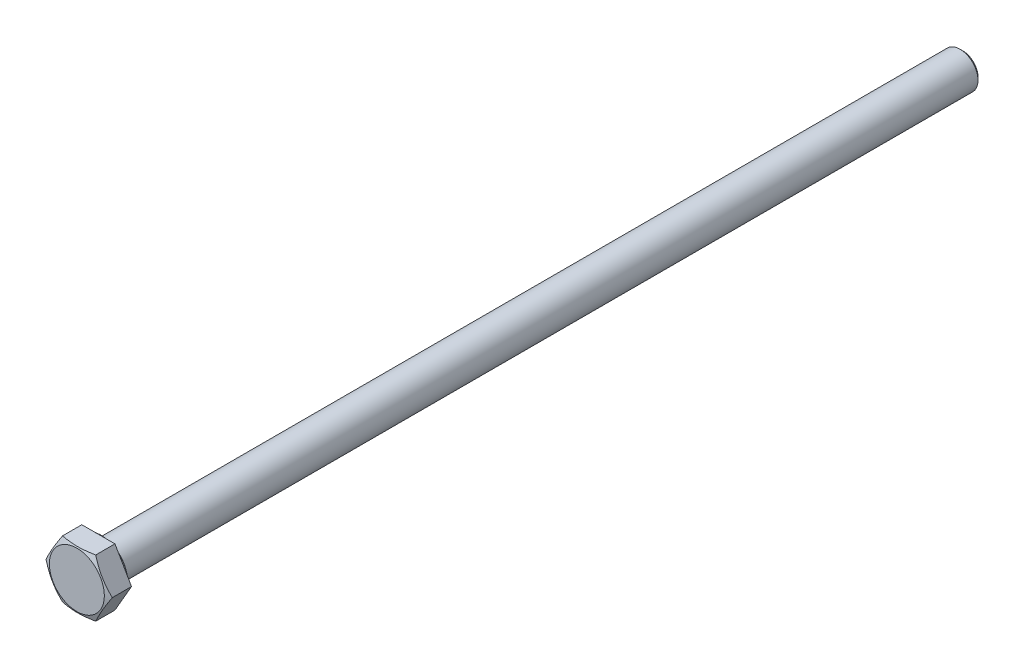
ISO-10303-21;
HEADER;
FILE_DESCRIPTION(('STEP AP214'),'2;1');
FILE_NAME('part.step','',(''),(''),'','','');
FILE_SCHEMA(('AUTOMOTIVE_DESIGN { 1 0 10303 214 1 1 1 1 }'));
ENDSEC;
DATA;
#1=APPLICATION_CONTEXT('core data for automotive mechanical design processes');
#2=APPLICATION_PROTOCOL_DEFINITION('international standard','automotive_design',2000,#1);
#3=PRODUCT_CONTEXT('',#1,'mechanical');
#4=PRODUCT('Part','Part','',(#3));
#5=PRODUCT_RELATED_PRODUCT_CATEGORY('part','',(#4));
#6=PRODUCT_DEFINITION_FORMATION('','',#4);
#7=PRODUCT_DEFINITION_CONTEXT('part definition',#1,'design');
#8=PRODUCT_DEFINITION('design','',#6,#7);
#9=PRODUCT_DEFINITION_SHAPE('','',#8);
#10=(LENGTH_UNIT() NAMED_UNIT(*) SI_UNIT(.MILLI.,.METRE.));
#11=(NAMED_UNIT(*) PLANE_ANGLE_UNIT() SI_UNIT($,.RADIAN.));
#12=(NAMED_UNIT(*) SI_UNIT($,.STERADIAN.) SOLID_ANGLE_UNIT());
#13=UNCERTAINTY_MEASURE_WITH_UNIT(LENGTH_MEASURE(1.E-05),#10,'distance_accuracy_value','');
#14=(GEOMETRIC_REPRESENTATION_CONTEXT(3) GLOBAL_UNCERTAINTY_ASSIGNED_CONTEXT((#13)) GLOBAL_UNIT_ASSIGNED_CONTEXT((#10,
#11,#12)) REPRESENTATION_CONTEXT('',''));
#15=CARTESIAN_POINT('',(0.,0.,0.));
#16=DIRECTION('',(0.,0.,1.));
#17=DIRECTION('',(1.,0.,0.));
#18=AXIS2_PLACEMENT_3D('',#15,#16,#17);
#19=CARTESIAN_POINT('',(0.,3.87,0.5));
#20=DIRECTION('',(0.,0.,1.));
#21=DIRECTION('',(1.,0.,0.));
#22=AXIS2_PLACEMENT_3D('',#19,#20,#21);
#23=PLANE('',#22);
#24=CARTESIAN_POINT('',(0.,0.,0.5));
#25=DIRECTION('',(0.,0.,1.));
#26=DIRECTION('',(1.,0.,0.));
#27=AXIS2_PLACEMENT_3D('',#24,#25,#26);
#28=CIRCLE('',#27,3.87);
#29=CARTESIAN_POINT('',(3.87,0.,0.5));
#30=VERTEX_POINT('',#29);
#31=EDGE_CURVE('E189',#30,#30,#28,.T.);
#32=ORIENTED_EDGE('',*,*,#31,.T.);
#33=EDGE_LOOP('',(#32));
#34=FACE_BOUND('',#33,.T.);
#35=DIRECTION('',(-1.,0.,0.));
#36=VECTOR('',#35,1.);
#37=CARTESIAN_POINT('',(0.,-3.99999813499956,0.5));
#38=LINE('',#37,#36);
#39=CARTESIAN_POINT('',(2.3094,-3.99999813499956,0.5));
#40=VERTEX_POINT('',#39);
#41=CARTESIAN_POINT('',(-2.3094,-3.99999813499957,0.5));
#42=VERTEX_POINT('',#41);
#43=EDGE_CURVE('E251',#40,#42,#38,.T.);
#44=ORIENTED_EDGE('',*,*,#43,.T.);
#45=DIRECTION('',(-0.5,0.866025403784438,0.));
#46=VECTOR('',#45,1.);
#47=CARTESIAN_POINT('',(-5.13985915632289,0.902500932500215,0.5));
#48=LINE('',#47,#46);
#49=CARTESIAN_POINT('',(-4.6188,0.,0.5));
#50=VERTEX_POINT('',#49);
#51=EDGE_CURVE('E103',#42,#50,#48,.T.);
#52=ORIENTED_EDGE('',*,*,#51,.T.);
#53=DIRECTION('',(0.5,0.866025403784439,0.));
#54=VECTOR('',#53,1.);
#55=CARTESIAN_POINT('',(-1.78834084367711,4.90249906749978,0.5));
#56=LINE('',#55,#54);
#57=CARTESIAN_POINT('',(-2.3094,3.99999813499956,0.5));
#58=VERTEX_POINT('',#57);
#59=EDGE_CURVE('E262',#50,#58,#56,.T.);
#60=ORIENTED_EDGE('',*,*,#59,.T.);
#61=DIRECTION('',(1.,0.,0.));
#62=VECTOR('',#61,1.);
#63=CARTESIAN_POINT('',(0.,3.99999813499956,0.5));
#64=LINE('',#63,#62);
#65=CARTESIAN_POINT('',(2.3094,3.99999813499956,0.5));
#66=VERTEX_POINT('',#65);
#67=EDGE_CURVE('E259',#58,#66,#64,.T.);
#68=ORIENTED_EDGE('',*,*,#67,.T.);
#69=DIRECTION('',(0.5,-0.866025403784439,0.));
#70=VECTOR('',#69,1.);
#71=CARTESIAN_POINT('',(1.78834084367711,4.90249906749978,0.5));
#72=LINE('',#71,#70);
#73=CARTESIAN_POINT('',(4.6188,0.,0.5));
#74=VERTEX_POINT('',#73);
#75=EDGE_CURVE('E236',#66,#74,#72,.T.);
#76=ORIENTED_EDGE('',*,*,#75,.T.);
#77=DIRECTION('',(-0.5,-0.866025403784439,0.));
#78=VECTOR('',#77,1.);
#79=CARTESIAN_POINT('',(5.13985915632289,0.902500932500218,0.5));
#80=LINE('',#79,#78);
#81=EDGE_CURVE('E254',#74,#40,#80,.T.);
#82=ORIENTED_EDGE('',*,*,#81,.T.);
#83=EDGE_LOOP('',(#44,#52,#60,#68,#76,#82));
#84=FACE_BOUND('',#83,.T.);
#85=ADVANCED_FACE('F38',(#34,#84),#23,.F.);
#86=CARTESIAN_POINT('',(0.,0.,3.5));
#87=DIRECTION('',(0.,0.,1.));
#88=DIRECTION('',(1.,0.,0.));
#89=AXIS2_PLACEMENT_3D('',#86,#87,#88);
#90=CYLINDRICAL_SURFACE('',#89,2.5);
#91=CARTESIAN_POINT('',(0.,0.,-119.6));
#92=DIRECTION('',(0.,0.,-1.));
#93=DIRECTION('',(-1.,0.,0.));
#94=AXIS2_PLACEMENT_3D('',#91,#92,#93);
#95=CIRCLE('',#94,2.5);
#96=CARTESIAN_POINT('',(-2.49999999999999,0.,-119.6));
#97=VERTEX_POINT('',#96);
#98=EDGE_CURVE('E11',#97,#97,#95,.F.);
#99=ORIENTED_EDGE('',*,*,#98,.T.);
#100=EDGE_LOOP('',(#99));
#101=FACE_BOUND('',#100,.T.);
#102=CARTESIAN_POINT('',(0.,0.,-0.25));
#103=DIRECTION('',(0.,0.,1.));
#104=DIRECTION('',(1.,0.,0.));
#105=AXIS2_PLACEMENT_3D('',#102,#103,#104);
#106=CIRCLE('',#105,2.5);
#107=CARTESIAN_POINT('',(2.5,0.,-0.25));
#108=VERTEX_POINT('',#107);
#109=EDGE_CURVE('E95',#108,#108,#106,.T.);
#110=ORIENTED_EDGE('',*,*,#109,.F.);
#111=EDGE_LOOP('',(#110));
#112=FACE_BOUND('',#111,.T.);
#113=ADVANCED_FACE('F151',(#101,#112),#90,.T.);
#114=CARTESIAN_POINT('',(0.,0.,-0.25));
#115=DIRECTION('',(0.,0.,1.));
#116=DIRECTION('',(1.,0.,0.));
#117=AXIS2_PLACEMENT_3D('',#114,#115,#116);
#118=TOROIDAL_SURFACE('',#117,2.75,0.25);
#119=ORIENTED_EDGE('',*,*,#109,.T.);
#120=EDGE_LOOP('',(#119));
#121=FACE_BOUND('',#120,.T.);
#122=CARTESIAN_POINT('',(0.,0.,0.));
#123=DIRECTION('',(0.,0.,1.));
#124=DIRECTION('',(1.,0.,0.));
#125=AXIS2_PLACEMENT_3D('',#122,#123,#124);
#126=CIRCLE('',#125,2.75);
#127=CARTESIAN_POINT('',(2.75,0.,0.));
#128=VERTEX_POINT('',#127);
#129=EDGE_CURVE('E177',#128,#128,#126,.T.);
#130=ORIENTED_EDGE('',*,*,#129,.F.);
#131=EDGE_LOOP('',(#130));
#132=FACE_BOUND('',#131,.T.);
#133=ADVANCED_FACE('F156',(#121,#132),#118,.F.);
#134=CARTESIAN_POINT('',(0.,2.75,0.));
#135=DIRECTION('',(0.,0.,1.));
#136=DIRECTION('',(1.,0.,0.));
#137=AXIS2_PLACEMENT_3D('',#134,#135,#136);
#138=PLANE('',#137);
#139=CARTESIAN_POINT('',(0.,0.,0.));
#140=DIRECTION('',(0.,0.,1.));
#141=DIRECTION('',(1.,0.,0.));
#142=AXIS2_PLACEMENT_3D('',#139,#140,#141);
#143=CIRCLE('',#142,3.37);
#144=CARTESIAN_POINT('',(3.37,0.,0.));
#145=VERTEX_POINT('',#144);
#146=EDGE_CURVE('E180',#145,#145,#143,.T.);
#147=ORIENTED_EDGE('',*,*,#146,.F.);
#148=EDGE_LOOP('',(#147));
#149=FACE_BOUND('',#148,.T.);
#150=ORIENTED_EDGE('',*,*,#129,.T.);
#151=EDGE_LOOP('',(#150));
#152=FACE_BOUND('',#151,.T.);
#153=ADVANCED_FACE('F163',(#149,#152),#138,.F.);
#154=CARTESIAN_POINT('',(0.,0.,0.5));
#155=DIRECTION('',(0.,0.,1.));
#156=DIRECTION('',(1.,0.,0.));
#157=AXIS2_PLACEMENT_3D('',#154,#155,#156);
#158=TOROIDAL_SURFACE('',#157,3.37,0.5);
#159=ORIENTED_EDGE('',*,*,#31,.F.);
#160=EDGE_LOOP('',(#159));
#161=FACE_BOUND('',#160,.T.);
#162=ORIENTED_EDGE('',*,*,#146,.T.);
#163=EDGE_LOOP('',(#162));
#164=FACE_BOUND('',#163,.T.);
#165=ADVANCED_FACE('F136',(#161,#164),#158,.T.);
#166=CARTESIAN_POINT('',(-2.3094,-3.99999813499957,-50.));
#167=DIRECTION('',(0.866025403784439,0.5,0.));
#168=DIRECTION('',(0.5,-0.866025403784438,0.));
#169=AXIS2_PLACEMENT_3D('',#166,#167,#168);
#170=PLANE('',#169);
#171=ORIENTED_EDGE('',*,*,#51,.F.);
#172=DIRECTION('',(0.,0.,1.));
#173=VECTOR('',#172,1.);
#174=CARTESIAN_POINT('',(-2.3094,-3.99999813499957,-50.));
#175=LINE('',#174,#173);
#176=CARTESIAN_POINT('',(-2.3094,-3.99999813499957,3.18181818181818));
#177=VERTEX_POINT('',#176);
#178=EDGE_CURVE('E53',#42,#177,#175,.T.);
#179=ORIENTED_EDGE('',*,*,#178,.T.);
#180=CARTESIAN_POINT('',(-4.61880115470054,2.E-06,3.1818177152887));
#181=CARTESIAN_POINT('',(-4.53811692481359,-0.139747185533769,3.21441815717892));
#182=CARTESIAN_POINT('',(-4.45716638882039,-0.279957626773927,3.24456251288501));
#183=CARTESIAN_POINT('',(-4.29473004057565,-0.561305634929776,3.29901256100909));
#184=CARTESIAN_POINT('',(-4.21324394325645,-0.702443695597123,3.32331483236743));
#185=CARTESIAN_POINT('',(-4.04985245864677,-0.985446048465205,3.36510771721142));
#186=CARTESIAN_POINT('',(-3.96794720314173,-1.12731011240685,3.38260035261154));
#187=CARTESIAN_POINT('',(-3.80383244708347,-1.41156520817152,3.40996332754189));
#188=CARTESIAN_POINT('',(-3.72162301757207,-1.55395611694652,3.4198353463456));
#189=CARTESIAN_POINT('',(-3.55845568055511,-1.83657023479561,3.43134318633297));
#190=CARTESIAN_POINT('',(-3.47750022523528,-1.97678919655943,3.43311601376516));
#191=CARTESIAN_POINT('',(-3.31563715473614,-2.25714425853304,3.42870268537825));
#192=CARTESIAN_POINT('',(-3.23472954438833,-2.39728035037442,3.4225158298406));
#193=CARTESIAN_POINT('',(-3.07321123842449,-2.67703826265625,3.40251631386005));
#194=CARTESIAN_POINT('',(-2.99260037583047,-2.81666037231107,3.38870894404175));
#195=CARTESIAN_POINT('',(-2.83175412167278,-3.0952542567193,3.35413575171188));
#196=CARTESIAN_POINT('',(-2.75151873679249,-3.23422601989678,3.33336980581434));
#197=CARTESIAN_POINT('',(-2.64125464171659,-3.42520903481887,3.30054505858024));
#198=CARTESIAN_POINT('',(-2.61102500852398,-3.47756829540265,3.2910995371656));
#199=CARTESIAN_POINT('',(-2.55063709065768,-3.58216323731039,3.27138597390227));
#200=CARTESIAN_POINT('',(-2.52047879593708,-3.6343989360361,3.26111805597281));
#201=CARTESIAN_POINT('',(-2.4601278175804,-3.73892989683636,3.23977065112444));
#202=CARTESIAN_POINT('',(-2.42993537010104,-3.79122474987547,3.22868850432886));
#203=CARTESIAN_POINT('',(-2.36961662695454,-3.89569987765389,3.20579085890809));
#204=CARTESIAN_POINT('',(-2.33949033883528,-3.94788013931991,3.19397528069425));
#205=CARTESIAN_POINT('',(-2.30939884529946,-4.00000013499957,3.1818177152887));
#206=B_SPLINE_CURVE_WITH_KNOTS('',3,(#180,#181,#182,#183,#184,#185,#186,#187,#188,#189,#190,
#191,#192,#193,#194,#195,#196,#197,#198,#199,#200,#201,#202,#203,#204,#205),.UNSPECIFIED.,.F.,
.F.,(4,2,2,2,2,2,2,2,2,2,2,2,4),(0.,0.493920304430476,0.988129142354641,1.48219112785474,
1.97614421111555,2.46170985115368,2.94731817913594,3.4325897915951,3.91787000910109,
4.10144449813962,4.2849913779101,4.46916707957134,4.65336280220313),.UNSPECIFIED.);
#207=CARTESIAN_POINT('',(-4.6188,0.,3.18181818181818));
#208=VERTEX_POINT('',#207);
#209=EDGE_CURVE('E100',#208,#177,#206,.T.);
#210=ORIENTED_EDGE('',*,*,#209,.F.);
#211=DIRECTION('',(0.,0.,1.));
#212=VECTOR('',#211,1.);
#213=CARTESIAN_POINT('',(-4.6188,0.,-50.));
#214=LINE('',#213,#212);
#215=EDGE_CURVE('E244',#50,#208,#214,.T.);
#216=ORIENTED_EDGE('',*,*,#215,.F.);
#217=EDGE_LOOP('',(#171,#179,#210,#216));
#218=FACE_BOUND('',#217,.T.);
#219=ADVANCED_FACE('F98',(#218),#170,.F.);
#220=CARTESIAN_POINT('',(-4.6188,0.,-50.));
#221=DIRECTION('',(0.866025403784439,-0.5,0.));
#222=DIRECTION('',(-0.5,-0.866025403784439,0.));
#223=AXIS2_PLACEMENT_3D('',#220,#221,#222);
#224=PLANE('',#223);
#225=ORIENTED_EDGE('',*,*,#59,.F.);
#226=ORIENTED_EDGE('',*,*,#215,.T.);
#227=CARTESIAN_POINT('',(-2.30939884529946,4.00000013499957,3.1818177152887));
#228=CARTESIAN_POINT('',(-2.39008307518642,3.8602509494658,3.21441815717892));
#229=CARTESIAN_POINT('',(-2.47103361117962,3.72004050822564,3.24456251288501));
#230=CARTESIAN_POINT('',(-2.63346995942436,3.4386925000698,3.29901256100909));
#231=CARTESIAN_POINT('',(-2.71495605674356,3.29755443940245,3.32331483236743));
#232=CARTESIAN_POINT('',(-2.87834754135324,3.01455208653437,3.36510771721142));
#233=CARTESIAN_POINT('',(-2.96025279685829,2.87268802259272,3.38260035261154));
#234=CARTESIAN_POINT('',(-3.12436755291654,2.58843292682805,3.40996332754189));
#235=CARTESIAN_POINT('',(-3.20657698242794,2.44604201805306,3.4198353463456));
#236=CARTESIAN_POINT('',(-3.3697443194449,2.16342790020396,3.43134318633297));
#237=CARTESIAN_POINT('',(-3.45069977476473,2.02320893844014,3.43311601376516));
#238=CARTESIAN_POINT('',(-3.61256284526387,1.74285387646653,3.42870268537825));
#239=CARTESIAN_POINT('',(-3.69347045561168,1.60271778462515,3.4225158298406));
#240=CARTESIAN_POINT('',(-3.85498876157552,1.32295987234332,3.40251631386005));
#241=CARTESIAN_POINT('',(-3.93559962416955,1.1833377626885,3.38870894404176));
#242=CARTESIAN_POINT('',(-4.09644587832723,0.90474387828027,3.35413575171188));
#243=CARTESIAN_POINT('',(-4.1766812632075,0.765772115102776,3.33336980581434));
#244=CARTESIAN_POINT('',(-4.28694535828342,0.574789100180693,3.30054505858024));
#245=CARTESIAN_POINT('',(-4.31717499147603,0.522429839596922,3.2910995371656));
#246=CARTESIAN_POINT('',(-4.37756290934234,0.417834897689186,3.27138597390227));
#247=CARTESIAN_POINT('',(-4.40772120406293,0.365599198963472,3.26111805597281));
#248=CARTESIAN_POINT('',(-4.46807218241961,0.261068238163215,3.23977065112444));
#249=CARTESIAN_POINT('',(-4.49826462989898,0.208773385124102,3.22868850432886));
#250=CARTESIAN_POINT('',(-4.55858337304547,0.104298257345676,3.20579085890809));
#251=CARTESIAN_POINT('',(-4.58870966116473,0.052117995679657,3.19397528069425));
#252=CARTESIAN_POINT('',(-4.61880115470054,-2.00000000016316E-06,3.1818177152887));
#253=B_SPLINE_CURVE_WITH_KNOTS('',3,(#227,#228,#229,#230,#231,#232,#233,#234,#235,#236,#237,
#238,#239,#240,#241,#242,#243,#244,#245,#246,#247,#248,#249,#250,#251,#252),.UNSPECIFIED.,.F.,
.F.,(4,2,2,2,2,2,2,2,2,2,2,2,4),(0.,0.493920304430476,0.988129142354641,1.48219112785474,
1.97614421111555,2.46170985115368,2.94731817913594,3.4325897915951,3.91787000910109,
4.10144449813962,4.2849913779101,4.46916707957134,4.65336280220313),.UNSPECIFIED.);
#254=CARTESIAN_POINT('',(-2.3094,3.99999813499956,3.18181818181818));
#255=VERTEX_POINT('',#254);
#256=EDGE_CURVE('E110',#255,#208,#253,.T.);
#257=ORIENTED_EDGE('',*,*,#256,.F.);
#258=DIRECTION('',(0.,0.,1.));
#259=VECTOR('',#258,1.);
#260=CARTESIAN_POINT('',(-2.3094,3.99999813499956,-50.));
#261=LINE('',#260,#259);
#262=EDGE_CURVE('E232',#58,#255,#261,.T.);
#263=ORIENTED_EDGE('',*,*,#262,.F.);
#264=EDGE_LOOP('',(#225,#226,#257,#263));
#265=FACE_BOUND('',#264,.T.);
#266=ADVANCED_FACE('F135',(#265),#224,.F.);
#267=CARTESIAN_POINT('',(-2.3094,3.99999813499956,-50.));
#268=DIRECTION('',(0.,-1.,0.));
#269=DIRECTION('',(-1.,0.,0.));
#270=AXIS2_PLACEMENT_3D('',#267,#268,#269);
#271=PLANE('',#270);
#272=ORIENTED_EDGE('',*,*,#67,.F.);
#273=ORIENTED_EDGE('',*,*,#262,.T.);
#274=CARTESIAN_POINT('',(-6.11067645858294,3.99999813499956,2.09715000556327));
#275=CARTESIAN_POINT('',(-5.93018632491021,3.99999813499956,2.15814592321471));
#276=CARTESIAN_POINT('',(-5.74945643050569,3.99999813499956,2.2184454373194));
#277=CARTESIAN_POINT('',(-5.38739304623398,3.99999813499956,2.33726257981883));
#278=CARTESIAN_POINT('',(-5.20605949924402,3.99999813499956,2.39578003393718));
#279=CARTESIAN_POINT('',(-4.84226295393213,3.99999813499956,2.51077003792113));
#280=CARTESIAN_POINT('',(-4.65979828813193,3.99999813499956,2.5672373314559));
#281=CARTESIAN_POINT('',(-4.29404590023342,3.99999813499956,2.6774346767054));
#282=CARTESIAN_POINT('',(-4.11075819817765,3.99999813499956,2.73116479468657));
#283=CARTESIAN_POINT('',(-3.74557106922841,3.99999813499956,2.83452971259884));
#284=CARTESIAN_POINT('',(-3.56368409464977,3.99999813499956,2.88420828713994));
#285=CARTESIAN_POINT('',(-3.1988178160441,3.99999813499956,2.97937518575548));
#286=CARTESIAN_POINT('',(-3.01583855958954,3.99999813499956,3.02486369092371));
#287=CARTESIAN_POINT('',(-2.64874025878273,3.99999813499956,3.11057149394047));
#288=CARTESIAN_POINT('',(-2.46462185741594,3.99999813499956,3.15079352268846));
#289=CARTESIAN_POINT('',(-2.09507613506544,3.99999813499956,3.22472474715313));
#290=CARTESIAN_POINT('',(-1.90964890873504,3.99999813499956,3.25843440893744));
#291=CARTESIAN_POINT('',(-1.57555684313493,3.99999813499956,3.31184858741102));
#292=CARTESIAN_POINT('',(-1.42712570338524,3.99999813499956,3.33300739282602));
#293=CARTESIAN_POINT('',(-1.12956343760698,3.99999813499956,3.36960414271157));
#294=CARTESIAN_POINT('',(-0.980432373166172,3.99999813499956,3.38504258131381));
#295=CARTESIAN_POINT('',(-0.681736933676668,3.99999813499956,3.40958981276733));
#296=CARTESIAN_POINT('',(-0.532172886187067,3.99999813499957,3.41870254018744));
#297=CARTESIAN_POINT('',(-0.232784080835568,3.99999813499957,3.43021557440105));
#298=CARTESIAN_POINT('',(-0.0829593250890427,3.99999813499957,3.43261593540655));
#299=CARTESIAN_POINT('',(0.2173717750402,3.99999813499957,3.4305886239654));
#300=CARTESIAN_POINT('',(0.367877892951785,3.99999813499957,3.42612770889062));
#301=CARTESIAN_POINT('',(0.668540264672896,3.99999813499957,3.41052150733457));
#302=CARTESIAN_POINT('',(0.818696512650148,3.99999813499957,3.39937611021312));
#303=CARTESIAN_POINT('',(1.11850826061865,3.99999813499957,3.3708710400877));
#304=CARTESIAN_POINT('',(1.26816337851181,3.99999813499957,3.35350739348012));
#305=CARTESIAN_POINT('',(1.56671005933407,3.99999813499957,3.31321780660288));
#306=CARTESIAN_POINT('',(1.71560162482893,3.99999813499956,3.29029188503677));
#307=CARTESIAN_POINT('',(2.21239191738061,3.99999813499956,3.20552499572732));
#308=CARTESIAN_POINT('',(2.55845254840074,3.99999813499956,3.13283426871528));
#309=CARTESIAN_POINT('',(3.07429026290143,3.99999813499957,3.01042449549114));
#310=CARTESIAN_POINT('',(3.24575279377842,3.99999813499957,2.96737505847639));
#311=CARTESIAN_POINT('',(3.58772715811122,3.99999813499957,2.8776390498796));
#312=CARTESIAN_POINT('',(3.75823902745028,3.99999813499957,2.83095261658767));
#313=CARTESIAN_POINT('',(4.09887652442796,3.99999813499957,2.73451924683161));
#314=CARTESIAN_POINT('',(4.26899992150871,3.99999813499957,2.68476450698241));
#315=CARTESIAN_POINT('',(4.60852857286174,3.99999813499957,2.58285668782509));
#316=CARTESIAN_POINT('',(4.77793381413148,3.99999813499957,2.53070356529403));
#317=CARTESIAN_POINT('',(5.28513456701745,3.99999813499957,2.37136550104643));
#318=CARTESIAN_POINT('',(5.6220154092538,3.99999813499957,2.26127286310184));
#319=CARTESIAN_POINT('',(6.29173831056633,3.99999813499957,2.03660917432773));
#320=CARTESIAN_POINT('',(6.62459228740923,3.99999813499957,1.92207330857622));
#321=CARTESIAN_POINT('',(7.28904413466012,3.99999813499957,1.68934195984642));
#322=CARTESIAN_POINT('',(7.62064190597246,3.99999813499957,1.57114619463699));
#323=CARTESIAN_POINT('',(8.28067027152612,3.99999813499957,1.33292357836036));
#324=CARTESIAN_POINT('',(8.60910721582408,3.99999813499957,1.21291426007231));
#325=CARTESIAN_POINT('',(9.26521110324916,3.99999813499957,0.970936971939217));
#326=CARTESIAN_POINT('',(9.59287814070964,3.99999813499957,0.848969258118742));
#327=CARTESIAN_POINT('',(9.92028776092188,3.99999813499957,0.726324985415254));
#328=B_SPLINE_CURVE_WITH_KNOTS('',3,(#274,#275,#276,#277,#278,#279,#280,#281,#282,#283,#284,
#285,#286,#287,#288,#289,#290,#291,#292,#293,#294,#295,#296,#297,#298,#299,#300,#301,#302,#303,
#304,#305,#306,#307,#308,#309,#310,#311,#312,#313,#314,#315,#316,#317,#318,#319,#320,#321,#322,
#323,#324,#325,#326,#327),.UNSPECIFIED.,.F.,.F.,(4,2,2,2,2,2,2,2,2,2,2,2,2,2,2,2,2,2,2,2,2,2,2,
2,2,2,4),(0.,0.57155948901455,1.14317469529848,1.71616460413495,2.28914063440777,
2.85474931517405,3.42033353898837,3.98562331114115,4.55087261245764,5.00057191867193,
5.45023237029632,5.89961288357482,6.34898976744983,6.80055073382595,7.25211917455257,
7.70397669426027,8.15583269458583,9.21578050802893,9.74612196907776,10.2764432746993,
10.8081738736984,11.3399140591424,12.4030812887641,13.459082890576,14.5151661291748,
15.564186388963,16.6130706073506),.UNSPECIFIED.);
#329=CARTESIAN_POINT('',(2.3094,3.99999813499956,3.18181818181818));
#330=VERTEX_POINT('',#329);
#331=EDGE_CURVE('E118',#330,#255,#328,.F.);
#332=ORIENTED_EDGE('',*,*,#331,.F.);
#333=DIRECTION('',(0.,0.,1.));
#334=VECTOR('',#333,1.);
#335=CARTESIAN_POINT('',(2.3094,3.99999813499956,-50.));
#336=LINE('',#335,#334);
#337=EDGE_CURVE('E229',#66,#330,#336,.T.);
#338=ORIENTED_EDGE('',*,*,#337,.F.);
#339=EDGE_LOOP('',(#272,#273,#332,#338));
#340=FACE_BOUND('',#339,.T.);
#341=ADVANCED_FACE('F210',(#340),#271,.F.);
#342=CARTESIAN_POINT('',(2.3094,3.99999813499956,-50.));
#343=DIRECTION('',(-0.866025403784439,-0.5,0.));
#344=DIRECTION('',(-0.5,0.866025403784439,0.));
#345=AXIS2_PLACEMENT_3D('',#342,#343,#344);
#346=PLANE('',#345);
#347=ORIENTED_EDGE('',*,*,#75,.F.);
#348=ORIENTED_EDGE('',*,*,#337,.T.);
#349=CARTESIAN_POINT('',(4.61880115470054,-1.99999999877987E-06,3.1818177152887));
#350=CARTESIAN_POINT('',(4.53811692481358,0.139747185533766,3.21441815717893));
#351=CARTESIAN_POINT('',(4.45716638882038,0.279957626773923,3.24456251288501));
#352=CARTESIAN_POINT('',(4.29473004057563,0.561305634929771,3.2990125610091));
#353=CARTESIAN_POINT('',(4.21324394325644,0.70244369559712,3.32331483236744));
#354=CARTESIAN_POINT('',(4.04985245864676,0.985446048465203,3.36510771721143));
#355=CARTESIAN_POINT('',(3.96794720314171,1.12731011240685,3.38260035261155));
#356=CARTESIAN_POINT('',(3.80383244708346,1.41156520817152,3.4099633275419));
#357=CARTESIAN_POINT('',(3.72162301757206,1.55395611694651,3.4198353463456));
#358=CARTESIAN_POINT('',(3.55845568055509,1.83657023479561,3.43134318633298));
#359=CARTESIAN_POINT('',(3.47750022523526,1.97678919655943,3.43311601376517));
#360=CARTESIAN_POINT('',(3.31563715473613,2.25714425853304,3.42870268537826));
#361=CARTESIAN_POINT('',(3.23472954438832,2.39728035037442,3.4225158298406));
#362=CARTESIAN_POINT('',(3.07321123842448,2.67703826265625,3.40251631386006));
#363=CARTESIAN_POINT('',(2.99260037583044,2.81666037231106,3.38870894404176));
#364=CARTESIAN_POINT('',(2.83175412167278,3.0952542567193,3.35413575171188));
#365=CARTESIAN_POINT('',(2.7515187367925,3.23422601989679,3.33336980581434));
#366=CARTESIAN_POINT('',(2.64125464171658,3.42520903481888,3.30054505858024));
#367=CARTESIAN_POINT('',(2.61102500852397,3.47756829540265,3.2910995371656));
#368=CARTESIAN_POINT('',(2.55063709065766,3.58216323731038,3.27138597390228));
#369=CARTESIAN_POINT('',(2.52047879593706,3.6343989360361,3.26111805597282));
#370=CARTESIAN_POINT('',(2.46012781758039,3.73892989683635,3.23977065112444));
#371=CARTESIAN_POINT('',(2.42993537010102,3.79122474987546,3.22868850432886));
#372=CARTESIAN_POINT('',(2.36961662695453,3.89569987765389,3.20579085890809));
#373=CARTESIAN_POINT('',(2.33949033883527,3.94788013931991,3.19397528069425));
#374=CARTESIAN_POINT('',(2.30939884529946,4.00000013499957,3.1818177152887));
#375=B_SPLINE_CURVE_WITH_KNOTS('',3,(#349,#350,#351,#352,#353,#354,#355,#356,#357,#358,#359,
#360,#361,#362,#363,#364,#365,#366,#367,#368,#369,#370,#371,#372,#373,#374),.UNSPECIFIED.,.F.,
.F.,(4,2,2,2,2,2,2,2,2,2,2,2,4),(0.,0.493920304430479,0.988129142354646,1.48219112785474,
1.97614421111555,2.46170985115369,2.94731817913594,3.4325897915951,3.9178700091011,
4.10144449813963,4.2849913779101,4.46916707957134,4.65336280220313),.UNSPECIFIED.);
#376=CARTESIAN_POINT('',(4.6188,0.,3.18181818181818));
#377=VERTEX_POINT('',#376);
#378=EDGE_CURVE('E213',#377,#330,#375,.T.);
#379=ORIENTED_EDGE('',*,*,#378,.F.);
#380=DIRECTION('',(0.,0.,1.));
#381=VECTOR('',#380,1.);
#382=CARTESIAN_POINT('',(4.6188,0.,-50.));
#383=LINE('',#382,#381);
#384=EDGE_CURVE('E238',#74,#377,#383,.T.);
#385=ORIENTED_EDGE('',*,*,#384,.F.);
#386=EDGE_LOOP('',(#347,#348,#379,#385));
#387=FACE_BOUND('',#386,.T.);
#388=ADVANCED_FACE('F206',(#387),#346,.F.);
#389=CARTESIAN_POINT('',(4.6188,0.,-50.));
#390=DIRECTION('',(-0.866025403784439,0.5,0.));
#391=DIRECTION('',(0.5,0.866025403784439,0.));
#392=AXIS2_PLACEMENT_3D('',#389,#390,#391);
#393=PLANE('',#392);
#394=ORIENTED_EDGE('',*,*,#81,.F.);
#395=ORIENTED_EDGE('',*,*,#384,.T.);
#396=CARTESIAN_POINT('',(2.30939884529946,-4.00000013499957,3.1818177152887));
#397=CARTESIAN_POINT('',(2.39008307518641,-3.8602509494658,3.21441815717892));
#398=CARTESIAN_POINT('',(2.47103361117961,-3.72004050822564,3.24456251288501));
#399=CARTESIAN_POINT('',(2.63346995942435,-3.43869250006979,3.2990125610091));
#400=CARTESIAN_POINT('',(2.71495605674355,-3.29755443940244,3.32331483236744));
#401=CARTESIAN_POINT('',(2.87834754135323,-3.01455208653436,3.36510771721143));
#402=CARTESIAN_POINT('',(2.96025279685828,-2.87268802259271,3.38260035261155));
#403=CARTESIAN_POINT('',(3.12436755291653,-2.58843292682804,3.4099633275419));
#404=CARTESIAN_POINT('',(3.20657698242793,-2.44604201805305,3.4198353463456));
#405=CARTESIAN_POINT('',(3.3697443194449,-2.16342790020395,3.43134318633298));
#406=CARTESIAN_POINT('',(3.45069977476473,-2.02320893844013,3.43311601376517));
#407=CARTESIAN_POINT('',(3.61256284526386,-1.74285387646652,3.42870268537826));
#408=CARTESIAN_POINT('',(3.69347045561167,-1.60271778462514,3.4225158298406));
#409=CARTESIAN_POINT('',(3.85498876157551,-1.32295987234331,3.40251631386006));
#410=CARTESIAN_POINT('',(3.93559962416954,-1.18333776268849,3.38870894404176));
#411=CARTESIAN_POINT('',(4.09644587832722,-0.904743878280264,3.35413575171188));
#412=CARTESIAN_POINT('',(4.17668126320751,-0.765772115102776,3.33336980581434));
#413=CARTESIAN_POINT('',(4.28694535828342,-0.574789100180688,3.30054505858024));
#414=CARTESIAN_POINT('',(4.31717499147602,-0.522429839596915,3.2910995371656));
#415=CARTESIAN_POINT('',(4.37756290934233,-0.417834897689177,3.27138597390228));
#416=CARTESIAN_POINT('',(4.40772120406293,-0.365599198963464,3.26111805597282));
#417=CARTESIAN_POINT('',(4.4680721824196,-0.261068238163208,3.23977065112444));
#418=CARTESIAN_POINT('',(4.49826462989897,-0.208773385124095,3.22868850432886));
#419=CARTESIAN_POINT('',(4.55858337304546,-0.10429825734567,3.20579085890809));
#420=CARTESIAN_POINT('',(4.58870966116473,-0.0521179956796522,3.19397528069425));
#421=CARTESIAN_POINT('',(4.61880115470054,2.00000000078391E-06,3.1818177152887));
#422=B_SPLINE_CURVE_WITH_KNOTS('',3,(#396,#397,#398,#399,#400,#401,#402,#403,#404,#405,#406,
#407,#408,#409,#410,#411,#412,#413,#414,#415,#416,#417,#418,#419,#420,#421),.UNSPECIFIED.,.F.,
.F.,(4,2,2,2,2,2,2,2,2,2,2,2,4),(0.,0.493920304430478,0.988129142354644,1.48219112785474,
1.97614421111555,2.46170985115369,2.94731817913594,3.4325897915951,3.91787000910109,
4.10144449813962,4.2849913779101,4.46916707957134,4.65336280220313),.UNSPECIFIED.);
#423=CARTESIAN_POINT('',(2.3094,-3.99999813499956,3.18181818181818));
#424=VERTEX_POINT('',#423);
#425=EDGE_CURVE('E94',#424,#377,#422,.T.);
#426=ORIENTED_EDGE('',*,*,#425,.F.);
#427=DIRECTION('',(0.,0.,1.));
#428=VECTOR('',#427,1.);
#429=CARTESIAN_POINT('',(2.3094,-3.99999813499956,-50.));
#430=LINE('',#429,#428);
#431=EDGE_CURVE('E58',#40,#424,#430,.T.);
#432=ORIENTED_EDGE('',*,*,#431,.F.);
#433=EDGE_LOOP('',(#394,#395,#426,#432));
#434=FACE_BOUND('',#433,.T.);
#435=ADVANCED_FACE('F147',(#434),#393,.F.);
#436=CARTESIAN_POINT('',(2.3094,-3.99999813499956,-50.));
#437=DIRECTION('',(0.,1.,0.));
#438=DIRECTION('',(1.,0.,0.));
#439=AXIS2_PLACEMENT_3D('',#436,#437,#438);
#440=PLANE('',#439);
#441=ORIENTED_EDGE('',*,*,#43,.F.);
#442=ORIENTED_EDGE('',*,*,#431,.T.);
#443=CARTESIAN_POINT('',(-6.11067645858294,-3.99999813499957,2.09715000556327));
#444=CARTESIAN_POINT('',(-5.93018632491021,-3.99999813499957,2.15814592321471));
#445=CARTESIAN_POINT('',(-5.74945643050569,-3.99999813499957,2.2184454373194));
#446=CARTESIAN_POINT('',(-5.38739304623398,-3.99999813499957,2.33726257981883));
#447=CARTESIAN_POINT('',(-5.20605949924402,-3.99999813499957,2.39578003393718));
#448=CARTESIAN_POINT('',(-4.84226295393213,-3.99999813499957,2.51077003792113));
#449=CARTESIAN_POINT('',(-4.65979828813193,-3.99999813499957,2.5672373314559));
#450=CARTESIAN_POINT('',(-4.29404590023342,-3.99999813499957,2.6774346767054));
#451=CARTESIAN_POINT('',(-4.11075819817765,-3.99999813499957,2.73116479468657));
#452=CARTESIAN_POINT('',(-3.74557106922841,-3.99999813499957,2.83452971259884));
#453=CARTESIAN_POINT('',(-3.56368409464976,-3.99999813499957,2.88420828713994));
#454=CARTESIAN_POINT('',(-3.19881781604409,-3.99999813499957,2.97937518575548));
#455=CARTESIAN_POINT('',(-3.01583855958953,-3.99999813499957,3.02486369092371));
#456=CARTESIAN_POINT('',(-2.64874025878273,-3.99999813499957,3.11057149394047));
#457=CARTESIAN_POINT('',(-2.46462185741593,-3.99999813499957,3.15079352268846));
#458=CARTESIAN_POINT('',(-2.09507613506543,-3.99999813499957,3.22472474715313));
#459=CARTESIAN_POINT('',(-1.90964890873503,-3.99999813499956,3.25843440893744));
#460=CARTESIAN_POINT('',(-1.57555684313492,-3.99999813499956,3.31184858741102));
#461=CARTESIAN_POINT('',(-1.42712570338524,-3.99999813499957,3.33300739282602));
#462=CARTESIAN_POINT('',(-1.12956343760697,-3.99999813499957,3.36960414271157));
#463=CARTESIAN_POINT('',(-0.980432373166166,-3.99999813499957,3.38504258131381));
#464=CARTESIAN_POINT('',(-0.681736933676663,-3.99999813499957,3.40958981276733));
#465=CARTESIAN_POINT('',(-0.532172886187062,-3.99999813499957,3.41870254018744));
#466=CARTESIAN_POINT('',(-0.232784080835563,-3.99999813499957,3.43021557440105));
#467=CARTESIAN_POINT('',(-0.0829593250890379,-3.99999813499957,3.43261593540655));
#468=CARTESIAN_POINT('',(0.217371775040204,-3.99999813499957,3.4305886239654));
#469=CARTESIAN_POINT('',(0.36787789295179,-3.99999813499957,3.42612770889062));
#470=CARTESIAN_POINT('',(0.668540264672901,-3.99999813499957,3.41052150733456));
#471=CARTESIAN_POINT('',(0.818696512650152,-3.99999813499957,3.39937611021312));
#472=CARTESIAN_POINT('',(1.11850826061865,-3.99999813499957,3.3708710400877));
#473=CARTESIAN_POINT('',(1.26816337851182,-3.99999813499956,3.35350739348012));
#474=CARTESIAN_POINT('',(1.56671005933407,-3.99999813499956,3.31321780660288));
#475=CARTESIAN_POINT('',(1.71560162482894,-3.99999813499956,3.29029188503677));
#476=CARTESIAN_POINT('',(2.21239191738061,-3.99999813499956,3.20552499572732));
#477=CARTESIAN_POINT('',(2.55845254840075,-3.99999813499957,3.13283426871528));
#478=CARTESIAN_POINT('',(3.07429026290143,-3.99999813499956,3.01042449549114));
#479=CARTESIAN_POINT('',(3.24575279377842,-3.99999813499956,2.96737505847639));
#480=CARTESIAN_POINT('',(3.58772715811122,-3.99999813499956,2.8776390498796));
#481=CARTESIAN_POINT('',(3.75823902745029,-3.99999813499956,2.83095261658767));
#482=CARTESIAN_POINT('',(4.09887652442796,-3.99999813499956,2.73451924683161));
#483=CARTESIAN_POINT('',(4.26899992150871,-3.99999813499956,2.68476450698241));
#484=CARTESIAN_POINT('',(4.60852857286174,-3.99999813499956,2.58285668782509));
#485=CARTESIAN_POINT('',(4.77793381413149,-3.99999813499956,2.53070356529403));
#486=CARTESIAN_POINT('',(5.28513456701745,-3.99999813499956,2.37136550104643));
#487=CARTESIAN_POINT('',(5.6220154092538,-3.99999813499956,2.26127286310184));
#488=CARTESIAN_POINT('',(6.29173831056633,-3.99999813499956,2.03660917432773));
#489=CARTESIAN_POINT('',(6.62459228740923,-3.99999813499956,1.92207330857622));
#490=CARTESIAN_POINT('',(7.28904413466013,-3.99999813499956,1.68934195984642));
#491=CARTESIAN_POINT('',(7.62064190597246,-3.99999813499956,1.57114619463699));
#492=CARTESIAN_POINT('',(8.28067027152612,-3.99999813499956,1.33292357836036));
#493=CARTESIAN_POINT('',(8.60910721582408,-3.99999813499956,1.21291426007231));
#494=CARTESIAN_POINT('',(9.26521110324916,-3.99999813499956,0.970936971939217));
#495=CARTESIAN_POINT('',(9.59287814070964,-3.99999813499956,0.848969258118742));
#496=CARTESIAN_POINT('',(9.92028776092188,-3.99999813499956,0.726324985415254));
#497=B_SPLINE_CURVE_WITH_KNOTS('',3,(#443,#444,#445,#446,#447,#448,#449,#450,#451,#452,#453,
#454,#455,#456,#457,#458,#459,#460,#461,#462,#463,#464,#465,#466,#467,#468,#469,#470,#471,#472,
#473,#474,#475,#476,#477,#478,#479,#480,#481,#482,#483,#484,#485,#486,#487,#488,#489,#490,#491,
#492,#493,#494,#495,#496),.UNSPECIFIED.,.F.,.F.,(4,2,2,2,2,2,2,2,2,2,2,2,2,2,2,2,2,2,2,2,2,2,2,
2,2,2,4),(0.,0.571559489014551,1.14317469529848,1.71616460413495,2.28914063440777,
2.85474931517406,3.42033353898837,3.98562331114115,4.55087261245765,5.00057191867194,
5.45023237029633,5.89961288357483,6.34898976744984,6.80055073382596,7.25211917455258,
7.70397669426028,8.15583269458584,9.21578050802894,9.74612196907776,10.2764432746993,
10.8081738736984,11.3399140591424,12.4030812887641,13.459082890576,14.5151661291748,
15.564186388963,16.6130706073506),.UNSPECIFIED.);
#498=EDGE_CURVE('E88',#177,#424,#497,.T.);
#499=ORIENTED_EDGE('',*,*,#498,.F.);
#500=ORIENTED_EDGE('',*,*,#178,.F.);
#501=EDGE_LOOP('',(#441,#442,#499,#500));
#502=FACE_BOUND('',#501,.T.);
#503=ADVANCED_FACE('F89',(#502),#440,.F.);
#504=CARTESIAN_POINT('',(0.,3.83127236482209,3.5));
#505=DIRECTION('',(0.,0.,-1.));
#506=DIRECTION('',(-1.,0.,0.));
#507=AXIS2_PLACEMENT_3D('',#504,#505,#506);
#508=PLANE('',#507);
#509=CARTESIAN_POINT('',(0.,0.,3.5));
#510=DIRECTION('',(0.,0.,1.));
#511=DIRECTION('',(1.,0.,0.));
#512=AXIS2_PLACEMENT_3D('',#509,#510,#511);
#513=CIRCLE('',#512,3.83127236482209);
#514=CARTESIAN_POINT('',(3.83127236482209,0.,3.5));
#515=VERTEX_POINT('',#514);
#516=EDGE_CURVE('E267',#515,#515,#513,.T.);
#517=ORIENTED_EDGE('',*,*,#516,.T.);
#518=EDGE_LOOP('',(#517));
#519=FACE_BOUND('',#518,.T.);
#520=ADVANCED_FACE('F139',(#519),#508,.F.);
#521=CARTESIAN_POINT('',(0.,0.,3.18181818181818));
#522=DIRECTION('',(0.,0.,-1.));
#523=DIRECTION('',(-1.,0.,0.));
#524=AXIS2_PLACEMENT_3D('',#521,#522,#523);
#525=CONICAL_SURFACE('',#524,4.6188,1.18682389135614);
#526=ORIENTED_EDGE('',*,*,#516,.F.);
#527=EDGE_LOOP('',(#526));
#528=FACE_BOUND('',#527,.T.);
#529=ORIENTED_EDGE('',*,*,#256,.T.);
#530=ORIENTED_EDGE('',*,*,#209,.T.);
#531=ORIENTED_EDGE('',*,*,#498,.T.);
#532=ORIENTED_EDGE('',*,*,#425,.T.);
#533=ORIENTED_EDGE('',*,*,#378,.T.);
#534=ORIENTED_EDGE('',*,*,#331,.T.);
#535=EDGE_LOOP('',(#529,#530,#531,#532,#533,#534));
#536=FACE_BOUND('',#535,.T.);
#537=ADVANCED_FACE('F108',(#528,#536),#525,.T.);
#538=CARTESIAN_POINT('',(0.,0.,-120.));
#539=DIRECTION('',(0.,0.,-1.));
#540=DIRECTION('',(-1.,0.,0.));
#541=AXIS2_PLACEMENT_3D('',#538,#539,#540);
#542=PLANE('',#541);
#543=CARTESIAN_POINT('',(0.,0.,-120.));
#544=DIRECTION('',(0.,0.,-1.));
#545=DIRECTION('',(-1.,0.,0.));
#546=AXIS2_PLACEMENT_3D('',#543,#544,#545);
#547=CIRCLE('',#546,2.09999999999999);
#548=CARTESIAN_POINT('',(-2.09999999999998,0.,-120.));
#549=VERTEX_POINT('',#548);
#550=EDGE_CURVE('E46',#549,#549,#547,.T.);
#551=ORIENTED_EDGE('',*,*,#550,.T.);
#552=EDGE_LOOP('',(#551));
#553=FACE_BOUND('',#552,.T.);
#554=ADVANCED_FACE('F145',(#553),#542,.T.);
#555=CARTESIAN_POINT('',(0.,0.,-120.));
#556=DIRECTION('',(0.,0.,1.));
#557=DIRECTION('',(1.,0.,0.));
#558=AXIS2_PLACEMENT_3D('',#555,#556,#557);
#559=CONICAL_SURFACE('',#558,2.09999999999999,0.785398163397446);
#560=ORIENTED_EDGE('',*,*,#98,.F.);
#561=EDGE_LOOP('',(#560));
#562=FACE_BOUND('',#561,.T.);
#563=ORIENTED_EDGE('',*,*,#550,.F.);
#564=EDGE_LOOP('',(#563));
#565=FACE_BOUND('',#564,.T.);
#566=ADVANCED_FACE('F40',(#562,#565),#559,.T.);
#567=CLOSED_SHELL('',(#85,#113,#133,#153,#165,#219,#266,#341,#388,#435,#503,#520,#537,#554,#566));
#568=MANIFOLD_SOLID_BREP('B2',#567);
#569=ADVANCED_BREP_SHAPE_REPRESENTATION('',(#18,#568),#14);
#570=SHAPE_DEFINITION_REPRESENTATION(#9,#569);
ENDSEC;
END-ISO-10303-21;
